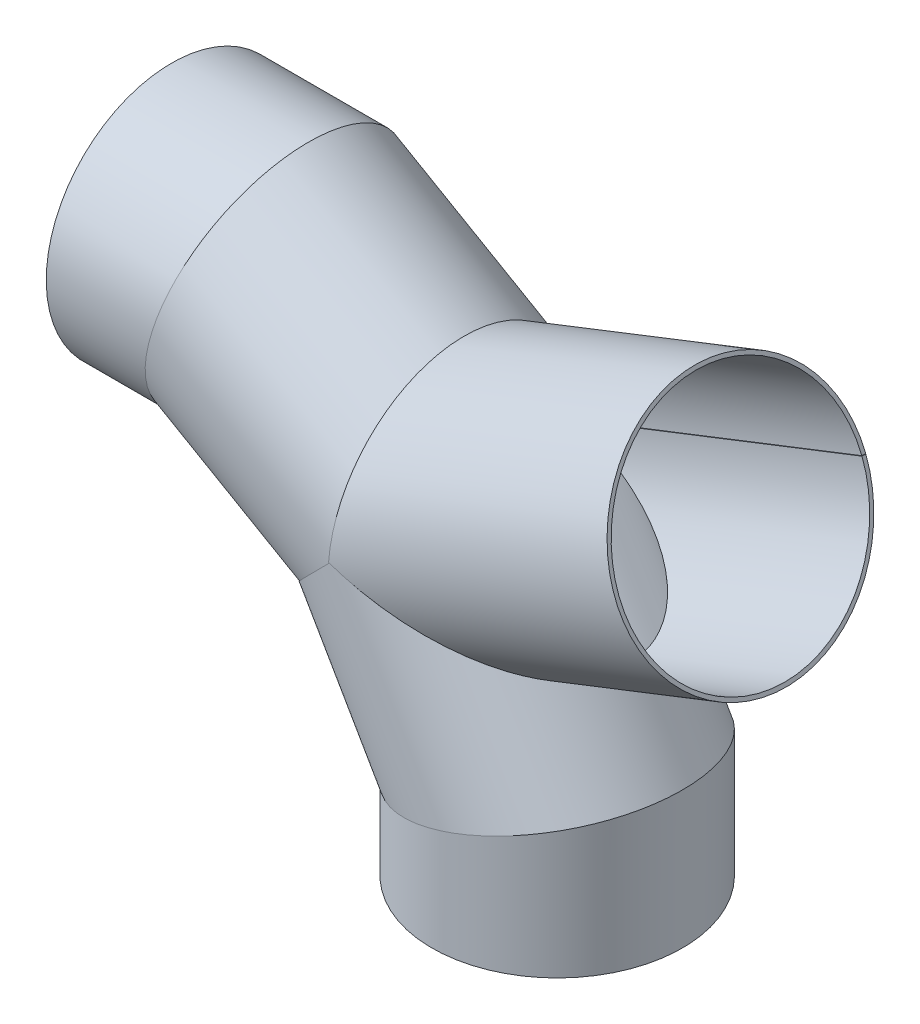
ISO-10303-21;
HEADER;
FILE_DESCRIPTION(('STEP AP214'),'2;1');
FILE_NAME('part.step','',(''),(''),'','','');
FILE_SCHEMA(('AUTOMOTIVE_DESIGN { 1 0 10303 214 1 1 1 1 }'));
ENDSEC;
DATA;
#1=APPLICATION_CONTEXT('core data for automotive mechanical design processes');
#2=APPLICATION_PROTOCOL_DEFINITION('international standard','automotive_design',2000,#1);
#3=PRODUCT_CONTEXT('',#1,'mechanical');
#4=PRODUCT('Part','Part','',(#3));
#5=PRODUCT_RELATED_PRODUCT_CATEGORY('part','',(#4));
#6=PRODUCT_DEFINITION_FORMATION('','',#4);
#7=PRODUCT_DEFINITION_CONTEXT('part definition',#1,'design');
#8=PRODUCT_DEFINITION('design','',#6,#7);
#9=PRODUCT_DEFINITION_SHAPE('','',#8);
#10=(LENGTH_UNIT() NAMED_UNIT(*) SI_UNIT(.MILLI.,.METRE.));
#11=(NAMED_UNIT(*) PLANE_ANGLE_UNIT() SI_UNIT($,.RADIAN.));
#12=(NAMED_UNIT(*) SI_UNIT($,.STERADIAN.) SOLID_ANGLE_UNIT());
#13=UNCERTAINTY_MEASURE_WITH_UNIT(LENGTH_MEASURE(1.E-05),#10,'distance_accuracy_value','');
#14=(GEOMETRIC_REPRESENTATION_CONTEXT(3) GLOBAL_UNCERTAINTY_ASSIGNED_CONTEXT((#13)) GLOBAL_UNIT_ASSIGNED_CONTEXT((#10,
#11,#12)) REPRESENTATION_CONTEXT('',''));
#15=CARTESIAN_POINT('',(0.,0.,0.));
#16=DIRECTION('',(0.,0.,1.));
#17=DIRECTION('',(1.,0.,0.));
#18=AXIS2_PLACEMENT_3D('',#15,#16,#17);
#19=CARTESIAN_POINT('',(-267.949192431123,732.050807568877,0.));
#20=DIRECTION('',(0.931256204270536,0.364365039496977,0.));
#21=DIRECTION('',(-0.364365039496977,0.931256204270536,0.));
#22=AXIS2_PLACEMENT_3D('',#19,#20,#21);
#23=CYLINDRICAL_SURFACE('',#22,325.);
#24=DIRECTION('',(0.931256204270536,0.364365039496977,0.));
#25=VECTOR('',#24,1.);
#26=CARTESIAN_POINT('',(-267.767009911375,731.585179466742,-324.999615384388));
#27=LINE('',#26,#25);
#28=CARTESIAN_POINT('',(475.3968278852,1022.35684882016,-324.999615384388));
#29=VERTEX_POINT('',#28);
#30=CARTESIAN_POINT('',(-267.225366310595,731.797103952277,-324.999615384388));
#31=VERTEX_POINT('',#30);
#32=EDGE_CURVE('E97',#29,#31,#27,.F.);
#33=ORIENTED_EDGE('',*,*,#32,.F.);
#34=CARTESIAN_POINT('',(475.214645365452,1022.8224769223,0.));
#35=DIRECTION('',(0.931256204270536,0.364365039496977,0.));
#36=DIRECTION('',(-0.364365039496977,0.931256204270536,0.));
#37=AXIS2_PLACEMENT_3D('',#34,#35,#36);
#38=CIRCLE('',#37,325.);
#39=CARTESIAN_POINT('',(475.032462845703,1023.28810502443,-324.999615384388));
#40=VERTEX_POINT('',#39);
#41=EDGE_CURVE('E141',#40,#29,#38,.T.);
#42=ORIENTED_EDGE('',*,*,#41,.F.);
#43=DIRECTION('',(0.931256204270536,0.364365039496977,0.));
#44=VECTOR('',#43,1.);
#45=CARTESIAN_POINT('',(-268.131374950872,732.516435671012,-324.999615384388));
#46=LINE('',#45,#44);
#47=CARTESIAN_POINT('',(-267.907440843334,732.604052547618,-324.999615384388));
#48=VERTEX_POINT('',#47);
#49=EDGE_CURVE('E127',#40,#48,#46,.F.);
#50=ORIENTED_EDGE('',*,*,#49,.T.);
#51=CARTESIAN_POINT('',(-267.949192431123,732.050807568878,0.));
#52=DIRECTION('',(-0.997164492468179,0.0752527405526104,0.));
#53=DIRECTION('',(0.0752527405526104,0.997164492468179,0.));
#54=AXIS2_PLACEMENT_3D('',#51,#52,#53);
#55=ELLIPSE('',#54,360.631810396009,325.);
#56=CARTESIAN_POINT('',(-267.949192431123,732.050807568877,325.));
#57=VERTEX_POINT('',#56);
#58=EDGE_CURVE('E161',#48,#57,#55,.F.);
#59=ORIENTED_EDGE('',*,*,#58,.T.);
#60=CARTESIAN_POINT('',(-267.949192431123,732.050807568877,0.));
#61=DIRECTION('',(-0.330773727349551,-0.943710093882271,0.));
#62=DIRECTION('',(0.943710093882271,-0.330773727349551,0.));
#63=AXIS2_PLACEMENT_3D('',#60,#61,#62);
#64=ELLIPSE('',#63,498.550329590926,325.);
#65=EDGE_CURVE('E151',#57,#31,#64,.F.);
#66=ORIENTED_EDGE('',*,*,#65,.T.);
#67=EDGE_LOOP('',(#33,#42,#50,#59,#66));
#68=FACE_BOUND('',#67,.T.);
#69=ADVANCED_FACE('F84',(#68),#23,.T.);
#70=CARTESIAN_POINT('',(-240.810660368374,1091.66004375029,-325.));
#71=DIRECTION('',(-0.997164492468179,0.0752527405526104,0.));
#72=DIRECTION('',(-0.0752527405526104,-0.997164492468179,0.));
#73=AXIS2_PLACEMENT_3D('',#70,#71,#72);
#74=PLANE('',#73);
#75=ORIENTED_EDGE('',*,*,#58,.F.);
#76=DIRECTION('',(0.,0.,1.));
#77=VECTOR('',#76,1.);
#78=CARTESIAN_POINT('',(-267.907440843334,732.604052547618,-325.));
#79=LINE('',#78,#77);
#80=CARTESIAN_POINT('',(-267.907440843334,732.604052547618,-314.999603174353));
#81=VERTEX_POINT('',#80);
#82=EDGE_CURVE('E91',#48,#81,#79,.T.);
#83=ORIENTED_EDGE('',*,*,#82,.T.);
#84=CARTESIAN_POINT('',(-267.949192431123,732.050807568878,0.));
#85=DIRECTION('',(-0.997164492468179,0.0752527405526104,0.));
#86=DIRECTION('',(0.0752527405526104,0.997164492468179,0.));
#87=AXIS2_PLACEMENT_3D('',#84,#85,#86);
#88=ELLIPSE('',#87,349.535446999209,315.);
#89=CARTESIAN_POINT('',(-267.949192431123,732.050807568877,315.));
#90=VERTEX_POINT('',#89);
#91=EDGE_CURVE('E147',#81,#90,#88,.F.);
#92=ORIENTED_EDGE('',*,*,#91,.T.);
#93=DIRECTION('',(0.,0.,1.));
#94=VECTOR('',#93,1.);
#95=CARTESIAN_POINT('',(-267.949192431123,732.050807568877,-325.));
#96=LINE('',#95,#94);
#97=EDGE_CURVE('E169',#90,#57,#96,.T.);
#98=ORIENTED_EDGE('',*,*,#97,.T.);
#99=EDGE_LOOP('',(#75,#83,#92,#98));
#100=FACE_BOUND('',#99,.T.);
#101=ADVANCED_FACE('F158',(#100),#74,.T.);
#102=CARTESIAN_POINT('',(-267.949192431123,732.050807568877,0.));
#103=DIRECTION('',(0.931256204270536,0.364365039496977,0.));
#104=DIRECTION('',(-0.364365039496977,0.931256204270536,0.));
#105=AXIS2_PLACEMENT_3D('',#102,#103,#104);
#106=CYLINDRICAL_SURFACE('',#105,315.);
#107=CARTESIAN_POINT('',(475.214645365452,1022.8224769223,0.));
#108=DIRECTION('',(0.931256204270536,0.364365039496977,0.));
#109=DIRECTION('',(-0.364365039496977,0.931256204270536,0.));
#110=AXIS2_PLACEMENT_3D('',#107,#108,#109);
#111=CIRCLE('',#110,315.);
#112=CARTESIAN_POINT('',(475.032462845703,1023.28810502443,-314.999603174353));
#113=VERTEX_POINT('',#112);
#114=CARTESIAN_POINT('',(475.3968278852,1022.35684882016,-314.999603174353));
#115=VERTEX_POINT('',#114);
#116=EDGE_CURVE('E143',#113,#115,#111,.T.);
#117=ORIENTED_EDGE('',*,*,#116,.T.);
#118=DIRECTION('',(0.931256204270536,0.364365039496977,0.));
#119=VECTOR('',#118,1.);
#120=CARTESIAN_POINT('',(-267.767009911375,731.585179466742,-314.999603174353));
#121=LINE('',#120,#119);
#122=CARTESIAN_POINT('',(-267.225366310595,731.797103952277,-314.999603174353));
#123=VERTEX_POINT('',#122);
#124=EDGE_CURVE('E134',#115,#123,#121,.F.);
#125=ORIENTED_EDGE('',*,*,#124,.T.);
#126=CARTESIAN_POINT('',(-267.949192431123,732.050807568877,0.));
#127=DIRECTION('',(-0.330773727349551,-0.943710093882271,0.));
#128=DIRECTION('',(0.943710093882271,-0.330773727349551,0.));
#129=AXIS2_PLACEMENT_3D('',#126,#127,#128);
#130=ELLIPSE('',#129,483.210319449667,315.);
#131=EDGE_CURVE('E149',#90,#123,#130,.F.);
#132=ORIENTED_EDGE('',*,*,#131,.F.);
#133=ORIENTED_EDGE('',*,*,#91,.F.);
#134=DIRECTION('',(0.931256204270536,0.364365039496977,0.));
#135=VECTOR('',#134,1.);
#136=CARTESIAN_POINT('',(-268.131374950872,732.516435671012,-314.999603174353));
#137=LINE('',#136,#135);
#138=EDGE_CURVE('E105',#113,#81,#137,.F.);
#139=ORIENTED_EDGE('',*,*,#138,.F.);
#140=EDGE_LOOP('',(#117,#125,#132,#133,#139));
#141=FACE_BOUND('',#140,.T.);
#142=ADVANCED_FACE('F164',(#141),#106,.F.);
#143=CARTESIAN_POINT('',(475.214645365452,1022.8224769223,0.));
#144=DIRECTION('',(0.931256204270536,0.364365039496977,0.));
#145=DIRECTION('',(-0.364365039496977,0.931256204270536,0.));
#146=AXIS2_PLACEMENT_3D('',#143,#144,#145);
#147=PLANE('',#146);
#148=DIRECTION('',(0.,0.,1.));
#149=VECTOR('',#148,1.);
#150=CARTESIAN_POINT('',(475.3968278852,1022.35684882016,-325.));
#151=LINE('',#150,#149);
#152=EDGE_CURVE('E144',#29,#115,#151,.T.);
#153=ORIENTED_EDGE('',*,*,#152,.T.);
#154=ORIENTED_EDGE('',*,*,#116,.F.);
#155=DIRECTION('',(0.,0.,1.));
#156=VECTOR('',#155,1.);
#157=CARTESIAN_POINT('',(475.032462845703,1023.28810502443,-325.));
#158=LINE('',#157,#156);
#159=EDGE_CURVE('E130',#40,#113,#158,.T.);
#160=ORIENTED_EDGE('',*,*,#159,.F.);
#161=ORIENTED_EDGE('',*,*,#41,.T.);
#162=EDGE_LOOP('',(#153,#154,#160,#161));
#163=FACE_BOUND('',#162,.T.);
#164=ADVANCED_FACE('F140',(#163),#147,.T.);
#165=CARTESIAN_POINT('',(-267.949192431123,732.050807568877,-325.));
#166=DIRECTION('',(-0.330773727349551,-0.943710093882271,0.));
#167=DIRECTION('',(0.943710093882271,-0.330773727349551,0.));
#168=AXIS2_PLACEMENT_3D('',#165,#166,#167);
#169=PLANE('',#168);
#170=DIRECTION('',(0.,0.,1.));
#171=VECTOR('',#170,1.);
#172=CARTESIAN_POINT('',(-267.225366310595,731.797103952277,-325.));
#173=LINE('',#172,#171);
#174=EDGE_CURVE('E14',#31,#123,#173,.T.);
#175=ORIENTED_EDGE('',*,*,#174,.F.);
#176=ORIENTED_EDGE('',*,*,#65,.F.);
#177=ORIENTED_EDGE('',*,*,#97,.F.);
#178=ORIENTED_EDGE('',*,*,#131,.T.);
#179=EDGE_LOOP('',(#175,#176,#177,#178));
#180=FACE_BOUND('',#179,.T.);
#181=ADVANCED_FACE('F167',(#180),#169,.T.);
#182=CARTESIAN_POINT('',(-268.131374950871,732.516435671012,-325.));
#183=DIRECTION('',(0.364365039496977,-0.931256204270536,0.));
#184=DIRECTION('',(0.931256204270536,0.364365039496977,0.));
#185=AXIS2_PLACEMENT_3D('',#182,#183,#184);
#186=PLANE('',#185);
#187=ORIENTED_EDGE('',*,*,#159,.T.);
#188=ORIENTED_EDGE('',*,*,#138,.T.);
#189=ORIENTED_EDGE('',*,*,#82,.F.);
#190=ORIENTED_EDGE('',*,*,#49,.F.);
#191=EDGE_LOOP('',(#187,#188,#189,#190));
#192=FACE_BOUND('',#191,.T.);
#193=ADVANCED_FACE('F129',(#192),#186,.T.);
#194=CARTESIAN_POINT('',(-267.767009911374,731.585179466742,-325.));
#195=DIRECTION('',(0.364365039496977,-0.931256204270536,0.));
#196=DIRECTION('',(0.931256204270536,0.364365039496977,0.));
#197=AXIS2_PLACEMENT_3D('',#194,#195,#196);
#198=PLANE('',#197);
#199=ORIENTED_EDGE('',*,*,#32,.T.);
#200=ORIENTED_EDGE('',*,*,#174,.T.);
#201=ORIENTED_EDGE('',*,*,#124,.F.);
#202=ORIENTED_EDGE('',*,*,#152,.F.);
#203=EDGE_LOOP('',(#199,#200,#201,#202));
#204=FACE_BOUND('',#203,.T.);
#205=ADVANCED_FACE('F176',(#204),#198,.F.);
#206=CLOSED_SHELL('',(#69,#101,#142,#164,#181,#193,#205));
#207=MANIFOLD_SOLID_BREP('B2',#206);
#208=CARTESIAN_POINT('',(-1000.,1000.,0.));
#209=DIRECTION('',(1.,0.,0.));
#210=DIRECTION('',(0.,1.,0.));
#211=AXIS2_PLACEMENT_3D('',#208,#209,#210);
#212=PLANE('',#211);
#213=DIRECTION('',(0.,-1.,0.));
#214=VECTOR('',#213,1.);
#215=CARTESIAN_POINT('',(-1000.,1000.,0.5));
#216=LINE('',#215,#214);
#217=CARTESIAN_POINT('',(-1000.,685.000396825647,0.49999999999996));
#218=VERTEX_POINT('',#217);
#219=CARTESIAN_POINT('',(-1000.,675.000384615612,0.499999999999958));
#220=VERTEX_POINT('',#219);
#221=EDGE_CURVE('E297',#218,#220,#216,.T.);
#222=ORIENTED_EDGE('',*,*,#221,.T.);
#223=CARTESIAN_POINT('',(-1000.,1000.,0.));
#224=DIRECTION('',(1.,0.,0.));
#225=DIRECTION('',(0.,1.,0.));
#226=AXIS2_PLACEMENT_3D('',#223,#224,#225);
#227=CIRCLE('',#226,325.);
#228=CARTESIAN_POINT('',(-1000.,675.000384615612,-0.500000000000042));
#229=VERTEX_POINT('',#228);
#230=EDGE_CURVE('E296',#229,#220,#227,.T.);
#231=ORIENTED_EDGE('',*,*,#230,.F.);
#232=DIRECTION('',(0.,-1.,0.));
#233=VECTOR('',#232,1.);
#234=CARTESIAN_POINT('',(-1000.,1000.,-0.5));
#235=LINE('',#234,#233);
#236=CARTESIAN_POINT('',(-1000.,685.000396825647,-0.50000000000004));
#237=VERTEX_POINT('',#236);
#238=EDGE_CURVE('E284',#237,#229,#235,.T.);
#239=ORIENTED_EDGE('',*,*,#238,.F.);
#240=CARTESIAN_POINT('',(-1000.,1000.,0.));
#241=DIRECTION('',(1.,0.,0.));
#242=DIRECTION('',(0.,0.,-1.));
#243=AXIS2_PLACEMENT_3D('',#240,#241,#242);
#244=CIRCLE('',#243,315.);
#245=EDGE_CURVE('E294',#237,#218,#244,.T.);
#246=ORIENTED_EDGE('',*,*,#245,.T.);
#247=EDGE_LOOP('',(#222,#231,#239,#246));
#248=FACE_BOUND('',#247,.T.);
#249=ADVANCED_FACE('F243',(#248),#212,.F.);
#250=CARTESIAN_POINT('',(-644.967320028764,1000.,0.));
#251=DIRECTION('',(-1.,0.,0.));
#252=DIRECTION('',(0.,-1.,0.));
#253=AXIS2_PLACEMENT_3D('',#250,#251,#252);
#254=CYLINDRICAL_SURFACE('',#253,325.);
#255=DIRECTION('',(-1.,0.,0.));
#256=VECTOR('',#255,1.);
#257=CARTESIAN_POINT('',(-644.967320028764,675.000384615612,0.499999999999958));
#258=LINE('',#257,#256);
#259=CARTESIAN_POINT('',(-819.13419205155,675.000384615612,0.500000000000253));
#260=VERTEX_POINT('',#259);
#261=EDGE_CURVE('E305',#260,#220,#258,.T.);
#262=ORIENTED_EDGE('',*,*,#261,.F.);
#263=CARTESIAN_POINT('',(-732.050807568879,1000.,0.));
#264=DIRECTION('',(-0.965925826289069,0.25881904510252,0.));
#265=DIRECTION('',(-0.25881904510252,-0.965925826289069,0.));
#266=AXIS2_PLACEMENT_3D('',#263,#264,#265);
#267=ELLIPSE('',#266,336.464758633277,325.);
#268=CARTESIAN_POINT('',(-819.13419205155,675.000384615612,-0.50000000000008));
#269=VERTEX_POINT('',#268);
#270=EDGE_CURVE('E300',#260,#269,#267,.T.);
#271=ORIENTED_EDGE('',*,*,#270,.T.);
#272=DIRECTION('',(-1.,0.,0.));
#273=VECTOR('',#272,1.);
#274=CARTESIAN_POINT('',(-644.967320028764,675.000384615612,-0.500000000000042));
#275=LINE('',#274,#273);
#276=EDGE_CURVE('E258',#269,#229,#275,.T.);
#277=ORIENTED_EDGE('',*,*,#276,.T.);
#278=ORIENTED_EDGE('',*,*,#230,.T.);
#279=EDGE_LOOP('',(#262,#271,#277,#278));
#280=FACE_BOUND('',#279,.T.);
#281=ADVANCED_FACE('F245',(#280),#254,.T.);
#282=CARTESIAN_POINT('',(-644.967320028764,1000.,0.));
#283=DIRECTION('',(-1.,0.,0.));
#284=DIRECTION('',(0.,-1.,0.));
#285=AXIS2_PLACEMENT_3D('',#282,#283,#284);
#286=CYLINDRICAL_SURFACE('',#285,315.);
#287=CARTESIAN_POINT('',(-732.050807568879,1000.,0.));
#288=DIRECTION('',(-0.965925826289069,0.25881904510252,0.));
#289=DIRECTION('',(-0.25881904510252,-0.965925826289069,0.));
#290=AXIS2_PLACEMENT_3D('',#287,#288,#289);
#291=ELLIPSE('',#290,326.111996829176,315.);
#292=CARTESIAN_POINT('',(-816.45469685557,685.000396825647,0.500000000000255));
#293=VERTEX_POINT('',#292);
#294=CARTESIAN_POINT('',(-816.45469685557,685.000396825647,-0.500000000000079));
#295=VERTEX_POINT('',#294);
#296=EDGE_CURVE('E302',#293,#295,#291,.T.);
#297=ORIENTED_EDGE('',*,*,#296,.F.);
#298=DIRECTION('',(-1.,0.,0.));
#299=VECTOR('',#298,1.);
#300=CARTESIAN_POINT('',(-644.967320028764,685.000396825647,0.49999999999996));
#301=LINE('',#300,#299);
#302=EDGE_CURVE('E265',#293,#218,#301,.T.);
#303=ORIENTED_EDGE('',*,*,#302,.T.);
#304=ORIENTED_EDGE('',*,*,#245,.F.);
#305=DIRECTION('',(-1.,0.,0.));
#306=VECTOR('',#305,1.);
#307=CARTESIAN_POINT('',(-644.967320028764,685.000396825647,-0.50000000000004));
#308=LINE('',#307,#306);
#309=EDGE_CURVE('E281',#295,#237,#308,.T.);
#310=ORIENTED_EDGE('',*,*,#309,.F.);
#311=EDGE_LOOP('',(#297,#303,#304,#310));
#312=FACE_BOUND('',#311,.T.);
#313=ADVANCED_FACE('F299',(#312),#286,.F.);
#314=CARTESIAN_POINT('',(-1000.,-1.22464679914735E-13,3121.67648647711));
#315=DIRECTION('',(-0.965925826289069,0.25881904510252,0.));
#316=DIRECTION('',(-0.25881904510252,-0.965925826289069,0.));
#317=AXIS2_PLACEMENT_3D('',#314,#315,#316);
#318=PLANE('',#317);
#319=DIRECTION('',(-0.25881904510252,-0.965925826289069,0.));
#320=VECTOR('',#319,1.);
#321=CARTESIAN_POINT('',(-1000.,2.50582721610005E-13,0.500000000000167));
#322=LINE('',#321,#320);
#323=EDGE_CURVE('E82',#293,#260,#322,.T.);
#324=ORIENTED_EDGE('',*,*,#323,.F.);
#325=ORIENTED_EDGE('',*,*,#296,.T.);
#326=DIRECTION('',(-0.25881904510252,-0.965925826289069,0.));
#327=VECTOR('',#326,1.);
#328=CARTESIAN_POINT('',(-1000.,2.5070224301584E-13,-0.500000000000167));
#329=LINE('',#328,#327);
#330=EDGE_CURVE('E251',#295,#269,#329,.T.);
#331=ORIENTED_EDGE('',*,*,#330,.T.);
#332=ORIENTED_EDGE('',*,*,#270,.F.);
#333=EDGE_LOOP('',(#324,#325,#331,#332));
#334=FACE_BOUND('',#333,.T.);
#335=ADVANCED_FACE('F311',(#334),#318,.F.);
#336=CARTESIAN_POINT('',(593.633283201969,1000.,-0.5));
#337=DIRECTION('',(0.,0.,-1.));
#338=DIRECTION('',(0.,1.,0.));
#339=AXIS2_PLACEMENT_3D('',#336,#337,#338);
#340=PLANE('',#339);
#341=ORIENTED_EDGE('',*,*,#330,.F.);
#342=ORIENTED_EDGE('',*,*,#309,.T.);
#343=ORIENTED_EDGE('',*,*,#238,.T.);
#344=ORIENTED_EDGE('',*,*,#276,.F.);
#345=EDGE_LOOP('',(#341,#342,#343,#344));
#346=FACE_BOUND('',#345,.T.);
#347=ADVANCED_FACE('F283',(#346),#340,.F.);
#348=CARTESIAN_POINT('',(593.633283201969,1000.,0.5));
#349=DIRECTION('',(0.,0.,-1.));
#350=DIRECTION('',(0.,1.,0.));
#351=AXIS2_PLACEMENT_3D('',#348,#349,#350);
#352=PLANE('',#351);
#353=ORIENTED_EDGE('',*,*,#261,.T.);
#354=ORIENTED_EDGE('',*,*,#221,.F.);
#355=ORIENTED_EDGE('',*,*,#302,.F.);
#356=ORIENTED_EDGE('',*,*,#323,.T.);
#357=EDGE_LOOP('',(#353,#354,#355,#356));
#358=FACE_BOUND('',#357,.T.);
#359=ADVANCED_FACE('F317',(#358),#352,.T.);
#360=CLOSED_SHELL('',(#249,#281,#313,#335,#347,#359));
#361=MANIFOLD_SOLID_BREP('B8',#360);
#362=CARTESIAN_POINT('',(-807.467320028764,1043.54174377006,0.));
#363=DIRECTION('',(0.866025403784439,-0.5,0.));
#364=DIRECTION('',(0.5,0.866025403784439,0.));
#365=AXIS2_PLACEMENT_3D('',#362,#363,#364);
#366=CYLINDRICAL_SURFACE('',#365,325.);
#367=CARTESIAN_POINT('',(-266.404258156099,731.158839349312,0.));
#368=DIRECTION('',(-0.71072374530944,0.703471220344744,0.));
#369=DIRECTION('',(0.703471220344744,0.71072374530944,0.));
#370=AXIS2_PLACEMENT_3D('',#367,#368,#369);
#371=ELLIPSE('',#370,336.007460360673,325.);
#372=CARTESIAN_POINT('',(-266.146718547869,731.419034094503,-324.999807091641));
#373=VERTEX_POINT('',#372);
#374=CARTESIAN_POINT('',(-502.775556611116,492.350641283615,-0.500000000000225));
#375=VERTEX_POINT('',#374);
#376=EDGE_CURVE('E456',#373,#375,#371,.T.);
#377=ORIENTED_EDGE('',*,*,#376,.T.);
#378=DIRECTION('',(0.866025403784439,-0.5,0.));
#379=VECTOR('',#378,1.);
#380=CARTESIAN_POINT('',(-969.967127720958,762.083820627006,-0.499999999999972));
#381=LINE('',#380,#379);
#382=CARTESIAN_POINT('',(-819.13419205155,675.000384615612,-0.499999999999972));
#383=VERTEX_POINT('',#382);
#384=EDGE_CURVE('E390',#375,#383,#381,.F.);
#385=ORIENTED_EDGE('',*,*,#384,.T.);
#386=CARTESIAN_POINT('',(-732.050807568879,1000.,0.));
#387=DIRECTION('',(-0.965925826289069,0.25881904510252,0.));
#388=DIRECTION('',(-0.25881904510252,-0.965925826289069,0.));
#389=AXIS2_PLACEMENT_3D('',#386,#387,#388);
#390=ELLIPSE('',#389,336.464758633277,325.);
#391=CARTESIAN_POINT('',(-819.13419205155,675.000384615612,0.500000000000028));
#392=VERTEX_POINT('',#391);
#393=EDGE_CURVE('E450',#392,#383,#390,.T.);
#394=ORIENTED_EDGE('',*,*,#393,.F.);
#395=DIRECTION('',(0.866025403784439,-0.5,0.));
#396=VECTOR('',#395,1.);
#397=CARTESIAN_POINT('',(-969.967127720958,762.083820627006,0.500000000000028));
#398=LINE('',#397,#396);
#399=CARTESIAN_POINT('',(-502.775556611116,492.350641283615,0.500000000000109));
#400=VERTEX_POINT('',#399);
#401=EDGE_CURVE('E438',#400,#392,#398,.F.);
#402=ORIENTED_EDGE('',*,*,#401,.F.);
#403=CARTESIAN_POINT('',(-266.146718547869,731.419034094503,324.999807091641));
#404=VERTEX_POINT('',#403);
#405=EDGE_CURVE('E447',#400,#404,#371,.T.);
#406=ORIENTED_EDGE('',*,*,#405,.T.);
#407=CARTESIAN_POINT('',(-267.949192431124,732.050807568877,0.));
#408=DIRECTION('',(-0.330773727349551,-0.943710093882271,0.));
#409=DIRECTION('',(0.943710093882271,-0.330773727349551,0.));
#410=AXIS2_PLACEMENT_3D('',#407,#408,#409);
#411=ELLIPSE('',#410,1752.99874294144,325.);
#412=CARTESIAN_POINT('',(-267.949192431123,732.050807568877,325.));
#413=VERTEX_POINT('',#412);
#414=EDGE_CURVE('E473',#404,#413,#411,.T.);
#415=ORIENTED_EDGE('',*,*,#414,.T.);
#416=CARTESIAN_POINT('',(-267.949192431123,732.050807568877,0.));
#417=DIRECTION('',(-0.997164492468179,0.0752527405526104,0.));
#418=DIRECTION('',(-0.0752527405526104,-0.997164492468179,0.));
#419=AXIS2_PLACEMENT_3D('',#416,#417,#418);
#420=ELLIPSE('',#419,360.631810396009,325.);
#421=CARTESIAN_POINT('',(-267.949192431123,732.050807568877,-325.));
#422=VERTEX_POINT('',#421);
#423=EDGE_CURVE('E477',#413,#422,#420,.T.);
#424=ORIENTED_EDGE('',*,*,#423,.T.);
#425=EDGE_CURVE('E476',#422,#373,#411,.T.);
#426=ORIENTED_EDGE('',*,*,#425,.T.);
#427=EDGE_LOOP('',(#377,#385,#394,#402,#406,#415,#424,#426));
#428=FACE_BOUND('',#427,.T.);
#429=ADVANCED_FACE('F376',(#428),#366,.T.);
#430=CARTESIAN_POINT('',(-1000.,-10.0000000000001,3121.67648647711));
#431=DIRECTION('',(-0.71072374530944,0.703471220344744,0.));
#432=DIRECTION('',(-0.703471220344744,-0.71072374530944,0.));
#433=AXIS2_PLACEMENT_3D('',#430,#431,#432);
#434=PLANE('',#433);
#435=DIRECTION('',(-0.703471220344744,-0.71072374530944,0.));
#436=VECTOR('',#435,1.);
#437=CARTESIAN_POINT('',(-1000.,-10.0000000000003,0.500000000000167));
#438=LINE('',#437,#436);
#439=CARTESIAN_POINT('',(-495.502576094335,499.698603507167,0.500000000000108));
#440=VERTEX_POINT('',#439);
#441=EDGE_CURVE('E383',#440,#400,#438,.T.);
#442=ORIENTED_EDGE('',*,*,#441,.F.);
#443=CARTESIAN_POINT('',(-266.404258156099,731.158839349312,0.));
#444=DIRECTION('',(-0.71072374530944,0.703471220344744,0.));
#445=DIRECTION('',(0.703471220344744,0.71072374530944,0.));
#446=AXIS2_PLACEMENT_3D('',#443,#444,#445);
#447=ELLIPSE('',#446,325.668769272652,315.);
#448=CARTESIAN_POINT('',(-266.146718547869,731.419034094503,314.999800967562));
#449=VERTEX_POINT('',#448);
#450=EDGE_CURVE('E461',#440,#449,#447,.T.);
#451=ORIENTED_EDGE('',*,*,#450,.T.);
#452=DIRECTION('',(0.,0.,-1.));
#453=VECTOR('',#452,1.);
#454=CARTESIAN_POINT('',(-266.146718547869,731.419034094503,-325.));
#455=LINE('',#454,#453);
#456=EDGE_CURVE('E443',#404,#449,#455,.T.);
#457=ORIENTED_EDGE('',*,*,#456,.F.);
#458=ORIENTED_EDGE('',*,*,#405,.F.);
#459=EDGE_LOOP('',(#442,#451,#457,#458));
#460=FACE_BOUND('',#459,.T.);
#461=ADVANCED_FACE('F453',(#460),#434,.F.);
#462=CARTESIAN_POINT('',(-807.467320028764,1043.54174377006,0.));
#463=DIRECTION('',(0.866025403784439,-0.5,0.));
#464=DIRECTION('',(0.5,0.866025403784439,0.));
#465=AXIS2_PLACEMENT_3D('',#462,#463,#464);
#466=CYLINDRICAL_SURFACE('',#465,315.);
#467=DIRECTION('',(0.866025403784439,-0.5,0.));
#468=VECTOR('',#467,1.);
#469=CARTESIAN_POINT('',(-964.96712161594,770.744085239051,-0.499999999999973));
#470=LINE('',#469,#468);
#471=CARTESIAN_POINT('',(-495.502576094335,499.698603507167,-0.500000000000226));
#472=VERTEX_POINT('',#471);
#473=CARTESIAN_POINT('',(-816.45469685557,685.000396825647,-0.499999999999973));
#474=VERTEX_POINT('',#473);
#475=EDGE_CURVE('E508',#472,#474,#470,.F.);
#476=ORIENTED_EDGE('',*,*,#475,.F.);
#477=CARTESIAN_POINT('',(-266.146718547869,731.419034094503,-314.999800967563));
#478=VERTEX_POINT('',#477);
#479=EDGE_CURVE('E457',#478,#472,#447,.T.);
#480=ORIENTED_EDGE('',*,*,#479,.F.);
#481=CARTESIAN_POINT('',(-267.949192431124,732.050807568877,0.));
#482=DIRECTION('',(-0.330773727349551,-0.943710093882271,0.));
#483=DIRECTION('',(0.943710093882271,-0.330773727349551,0.));
#484=AXIS2_PLACEMENT_3D('',#481,#482,#483);
#485=ELLIPSE('',#484,1699.0603200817,315.);
#486=CARTESIAN_POINT('',(-267.949192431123,732.050807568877,-315.));
#487=VERTEX_POINT('',#486);
#488=EDGE_CURVE('E474',#487,#478,#485,.T.);
#489=ORIENTED_EDGE('',*,*,#488,.F.);
#490=CARTESIAN_POINT('',(-267.949192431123,732.050807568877,0.));
#491=DIRECTION('',(-0.997164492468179,0.0752527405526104,0.));
#492=DIRECTION('',(-0.0752527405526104,-0.997164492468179,0.));
#493=AXIS2_PLACEMENT_3D('',#490,#491,#492);
#494=ELLIPSE('',#493,349.535446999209,315.);
#495=CARTESIAN_POINT('',(-267.949192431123,732.050807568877,315.));
#496=VERTEX_POINT('',#495);
#497=EDGE_CURVE('E481',#496,#487,#494,.T.);
#498=ORIENTED_EDGE('',*,*,#497,.F.);
#499=EDGE_CURVE('E471',#449,#496,#485,.T.);
#500=ORIENTED_EDGE('',*,*,#499,.F.);
#501=ORIENTED_EDGE('',*,*,#450,.F.);
#502=DIRECTION('',(0.866025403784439,-0.5,0.));
#503=VECTOR('',#502,1.);
#504=CARTESIAN_POINT('',(-964.96712161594,770.744085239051,0.500000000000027));
#505=LINE('',#504,#503);
#506=CARTESIAN_POINT('',(-816.45469685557,685.000396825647,0.500000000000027));
#507=VERTEX_POINT('',#506);
#508=EDGE_CURVE('E397',#440,#507,#505,.F.);
#509=ORIENTED_EDGE('',*,*,#508,.T.);
#510=CARTESIAN_POINT('',(-732.050807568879,1000.,0.));
#511=DIRECTION('',(-0.965925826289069,0.25881904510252,0.));
#512=DIRECTION('',(-0.25881904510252,-0.965925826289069,0.));
#513=AXIS2_PLACEMENT_3D('',#510,#511,#512);
#514=ELLIPSE('',#513,326.111996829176,315.);
#515=EDGE_CURVE('E479',#507,#474,#514,.T.);
#516=ORIENTED_EDGE('',*,*,#515,.T.);
#517=EDGE_LOOP('',(#476,#480,#489,#498,#500,#501,#509,#516));
#518=FACE_BOUND('',#517,.T.);
#519=ADVANCED_FACE('F493',(#518),#466,.F.);
#520=CARTESIAN_POINT('',(-1000.,-1.22464679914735E-13,3121.67648647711));
#521=DIRECTION('',(-0.965925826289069,0.25881904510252,0.));
#522=DIRECTION('',(-0.25881904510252,-0.965925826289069,0.));
#523=AXIS2_PLACEMENT_3D('',#520,#521,#522);
#524=PLANE('',#523);
#525=DIRECTION('',(-0.25881904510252,-0.965925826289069,0.));
#526=VECTOR('',#525,1.);
#527=CARTESIAN_POINT('',(-1000.,-3.71242628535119E-13,-0.500000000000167));
#528=LINE('',#527,#526);
#529=EDGE_CURVE('E512',#474,#383,#528,.T.);
#530=ORIENTED_EDGE('',*,*,#529,.F.);
#531=ORIENTED_EDGE('',*,*,#515,.F.);
#532=DIRECTION('',(-0.25881904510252,-0.965925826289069,0.));
#533=VECTOR('',#532,1.);
#534=CARTESIAN_POINT('',(-1000.,-3.71162947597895E-13,0.500000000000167));
#535=LINE('',#534,#533);
#536=EDGE_CURVE('E451',#507,#392,#535,.T.);
#537=ORIENTED_EDGE('',*,*,#536,.T.);
#538=ORIENTED_EDGE('',*,*,#393,.T.);
#539=EDGE_LOOP('',(#530,#531,#537,#538));
#540=FACE_BOUND('',#539,.T.);
#541=ADVANCED_FACE('F516',(#540),#524,.T.);
#542=CARTESIAN_POINT('',(-240.810660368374,1091.66004375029,-325.));
#543=DIRECTION('',(-0.997164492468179,0.0752527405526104,0.));
#544=DIRECTION('',(-0.0752527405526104,-0.997164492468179,0.));
#545=AXIS2_PLACEMENT_3D('',#542,#543,#544);
#546=PLANE('',#545);
#547=DIRECTION('',(0.,0.,1.));
#548=VECTOR('',#547,1.);
#549=CARTESIAN_POINT('',(-267.949192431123,732.050807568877,-325.));
#550=LINE('',#549,#548);
#551=EDGE_CURVE('E467',#496,#413,#550,.T.);
#552=ORIENTED_EDGE('',*,*,#551,.F.);
#553=ORIENTED_EDGE('',*,*,#497,.T.);
#554=EDGE_CURVE('E468',#422,#487,#550,.T.);
#555=ORIENTED_EDGE('',*,*,#554,.F.);
#556=ORIENTED_EDGE('',*,*,#423,.F.);
#557=EDGE_LOOP('',(#552,#553,#555,#556));
#558=FACE_BOUND('',#557,.T.);
#559=ADVANCED_FACE('F499',(#558),#546,.F.);
#560=CARTESIAN_POINT('',(-267.949192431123,732.050807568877,-325.));
#561=DIRECTION('',(-0.330773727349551,-0.943710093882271,0.));
#562=DIRECTION('',(0.943710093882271,-0.330773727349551,0.));
#563=AXIS2_PLACEMENT_3D('',#560,#561,#562);
#564=PLANE('',#563);
#565=ORIENTED_EDGE('',*,*,#488,.T.);
#566=DIRECTION('',(0.,0.,-1.));
#567=VECTOR('',#566,1.);
#568=CARTESIAN_POINT('',(-266.146718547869,731.419034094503,-325.));
#569=LINE('',#568,#567);
#570=EDGE_CURVE('E459',#478,#373,#569,.T.);
#571=ORIENTED_EDGE('',*,*,#570,.T.);
#572=ORIENTED_EDGE('',*,*,#425,.F.);
#573=ORIENTED_EDGE('',*,*,#554,.T.);
#574=EDGE_LOOP('',(#565,#571,#572,#573));
#575=FACE_BOUND('',#574,.T.);
#576=ADVANCED_FACE('F503',(#575),#564,.F.);
#577=ORIENTED_EDGE('',*,*,#414,.F.);
#578=ORIENTED_EDGE('',*,*,#456,.T.);
#579=ORIENTED_EDGE('',*,*,#499,.T.);
#580=ORIENTED_EDGE('',*,*,#551,.T.);
#581=EDGE_LOOP('',(#577,#578,#579,#580));
#582=FACE_BOUND('',#581,.T.);
#583=ADVANCED_FACE('F487',(#582),#564,.F.);
#584=ORIENTED_EDGE('',*,*,#479,.T.);
#585=DIRECTION('',(-0.703471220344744,-0.71072374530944,0.));
#586=VECTOR('',#585,1.);
#587=CARTESIAN_POINT('',(-1000.,-10.0000000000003,-0.500000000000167));
#588=LINE('',#587,#586);
#589=EDGE_CURVE('E241',#472,#375,#588,.T.);
#590=ORIENTED_EDGE('',*,*,#589,.T.);
#591=ORIENTED_EDGE('',*,*,#376,.F.);
#592=ORIENTED_EDGE('',*,*,#570,.F.);
#593=EDGE_LOOP('',(#584,#590,#591,#592));
#594=FACE_BOUND('',#593,.T.);
#595=ADVANCED_FACE('F506',(#594),#434,.F.);
#596=CARTESIAN_POINT('',(695.224962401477,175.961949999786,0.5));
#597=DIRECTION('',(0.,0.,-1.));
#598=DIRECTION('',(0.,1.,0.));
#599=AXIS2_PLACEMENT_3D('',#596,#597,#598);
#600=PLANE('',#599);
#601=ORIENTED_EDGE('',*,*,#508,.F.);
#602=ORIENTED_EDGE('',*,*,#441,.T.);
#603=ORIENTED_EDGE('',*,*,#401,.T.);
#604=ORIENTED_EDGE('',*,*,#536,.F.);
#605=EDGE_LOOP('',(#601,#602,#603,#604));
#606=FACE_BOUND('',#605,.T.);
#607=ADVANCED_FACE('F437',(#606),#600,.T.);
#608=CARTESIAN_POINT('',(695.224962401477,175.961949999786,-0.5));
#609=DIRECTION('',(0.,0.,-1.));
#610=DIRECTION('',(0.,1.,0.));
#611=AXIS2_PLACEMENT_3D('',#608,#609,#610);
#612=PLANE('',#611);
#613=ORIENTED_EDGE('',*,*,#529,.T.);
#614=ORIENTED_EDGE('',*,*,#384,.F.);
#615=ORIENTED_EDGE('',*,*,#589,.F.);
#616=ORIENTED_EDGE('',*,*,#475,.T.);
#617=EDGE_LOOP('',(#613,#614,#615,#616));
#618=FACE_BOUND('',#617,.T.);
#619=ADVANCED_FACE('F507',(#618),#612,.F.);
#620=CLOSED_SHELL('',(#429,#461,#519,#541,#559,#576,#583,#595,#607,#619));
#621=MANIFOLD_SOLID_BREP('B76',#620);
#622=CARTESIAN_POINT('',(-311.49093620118,807.467320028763,0.));
#623=DIRECTION('',(0.5,-0.866025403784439,0.));
#624=DIRECTION('',(0.866025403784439,0.5,0.));
#625=AXIS2_PLACEMENT_3D('',#622,#623,#624);
#626=CYLINDRICAL_SURFACE('',#625,324.999999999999);
#627=DIRECTION('',(0.5,-0.866025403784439,0.));
#628=VECTOR('',#627,1.);
#629=CARTESIAN_POINT('',(-592.948859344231,644.967512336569,0.499999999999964));
#630=LINE('',#629,#628);
#631=CARTESIAN_POINT('',(-324.999615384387,180.86580794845,0.499999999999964));
#632=VERTEX_POINT('',#631);
#633=CARTESIAN_POINT('',(-504.076578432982,491.036206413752,0.500000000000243));
#634=VERTEX_POINT('',#633);
#635=EDGE_CURVE('E626',#632,#634,#630,.F.);
#636=ORIENTED_EDGE('',*,*,#635,.F.);
#637=CARTESIAN_POINT('',(7.21644966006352E-13,267.949192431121,0.));
#638=DIRECTION('',(-0.25881904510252,0.965925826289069,0.));
#639=DIRECTION('',(0.965925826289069,0.25881904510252,0.));
#640=AXIS2_PLACEMENT_3D('',#637,#638,#639);
#641=ELLIPSE('',#640,336.464758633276,324.999999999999);
#642=CARTESIAN_POINT('',(-324.999615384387,180.86580794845,-0.500000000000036));
#643=VERTEX_POINT('',#642);
#644=EDGE_CURVE('E667',#643,#632,#641,.F.);
#645=ORIENTED_EDGE('',*,*,#644,.F.);
#646=DIRECTION('',(0.5,-0.866025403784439,0.));
#647=VECTOR('',#646,1.);
#648=CARTESIAN_POINT('',(-592.948859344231,644.967512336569,-0.500000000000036));
#649=LINE('',#648,#647);
#650=CARTESIAN_POINT('',(-504.076578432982,491.036206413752,-0.500000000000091));
#651=VERTEX_POINT('',#650);
#652=EDGE_CURVE('E655',#643,#651,#649,.F.);
#653=ORIENTED_EDGE('',*,*,#652,.T.);
#654=CARTESIAN_POINT('',(-267.05476945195,730.501621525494,0.));
#655=DIRECTION('',(-0.71072374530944,0.703471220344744,0.));
#656=DIRECTION('',(-0.703471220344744,-0.71072374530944,0.));
#657=AXIS2_PLACEMENT_3D('',#654,#655,#656);
#658=ELLIPSE('',#657,336.932176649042,324.999999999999);
#659=CARTESIAN_POINT('',(-266.146718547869,731.419034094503,-324.997614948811));
#660=VERTEX_POINT('',#659);
#661=EDGE_CURVE('E664',#651,#660,#658,.F.);
#662=ORIENTED_EDGE('',*,*,#661,.T.);
#663=CARTESIAN_POINT('',(-267.949192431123,732.050807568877,0.));
#664=DIRECTION('',(-0.330773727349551,-0.943710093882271,0.));
#665=DIRECTION('',(0.943710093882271,-0.330773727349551,0.));
#666=AXIS2_PLACEMENT_3D('',#663,#664,#665);
#667=ELLIPSE('',#666,498.550329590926,324.999999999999);
#668=CARTESIAN_POINT('',(-266.146718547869,731.419034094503,324.99761494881));
#669=VERTEX_POINT('',#668);
#670=EDGE_CURVE('E678',#669,#660,#667,.F.);
#671=ORIENTED_EDGE('',*,*,#670,.F.);
#672=EDGE_CURVE('E674',#669,#634,#658,.F.);
#673=ORIENTED_EDGE('',*,*,#672,.T.);
#674=EDGE_LOOP('',(#636,#645,#653,#662,#671,#673));
#675=FACE_BOUND('',#674,.T.);
#676=ADVANCED_FACE('F605',(#675),#626,.T.);
#677=CARTESIAN_POINT('',(-1000.,-10.0000000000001,3121.67648647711));
#678=DIRECTION('',(-0.71072374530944,0.703471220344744,0.));
#679=DIRECTION('',(-0.703471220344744,-0.71072374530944,0.));
#680=AXIS2_PLACEMENT_3D('',#677,#678,#679);
#681=PLANE('',#680);
#682=ORIENTED_EDGE('',*,*,#661,.F.);
#683=DIRECTION('',(0.703471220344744,0.71072374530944,0.));
#684=VECTOR('',#683,1.);
#685=CARTESIAN_POINT('',(-1000.,-9.99999999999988,-0.500000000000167));
#686=LINE('',#685,#684);
#687=CARTESIAN_POINT('',(-496.783582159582,498.404390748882,-0.50000000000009));
#688=VERTEX_POINT('',#687);
#689=EDGE_CURVE('E612',#651,#688,#686,.T.);
#690=ORIENTED_EDGE('',*,*,#689,.T.);
#691=CARTESIAN_POINT('',(-267.05476945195,730.501621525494,0.));
#692=DIRECTION('',(-0.71072374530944,0.703471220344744,0.));
#693=DIRECTION('',(-0.703471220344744,-0.71072374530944,0.));
#694=AXIS2_PLACEMENT_3D('',#691,#692,#693);
#695=ELLIPSE('',#694,326.565032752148,314.999999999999);
#696=CARTESIAN_POINT('',(-266.146718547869,731.419034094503,-314.997539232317));
#697=VERTEX_POINT('',#696);
#698=EDGE_CURVE('E680',#688,#697,#695,.F.);
#699=ORIENTED_EDGE('',*,*,#698,.T.);
#700=DIRECTION('',(0.,0.,-1.));
#701=VECTOR('',#700,1.);
#702=CARTESIAN_POINT('',(-266.146718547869,731.419034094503,-325.));
#703=LINE('',#702,#701);
#704=EDGE_CURVE('E673',#697,#660,#703,.T.);
#705=ORIENTED_EDGE('',*,*,#704,.T.);
#706=EDGE_LOOP('',(#682,#690,#699,#705));
#707=FACE_BOUND('',#706,.T.);
#708=ADVANCED_FACE('F671',(#707),#681,.T.);
#709=CARTESIAN_POINT('',(-311.49093620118,807.467320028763,0.));
#710=DIRECTION('',(0.5,-0.866025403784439,0.));
#711=DIRECTION('',(0.866025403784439,0.5,0.));
#712=AXIS2_PLACEMENT_3D('',#709,#710,#711);
#713=CYLINDRICAL_SURFACE('',#712,314.999999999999);
#714=CARTESIAN_POINT('',(7.21644966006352E-13,267.949192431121,0.));
#715=DIRECTION('',(-0.25881904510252,0.965925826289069,0.));
#716=DIRECTION('',(0.965925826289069,0.25881904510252,0.));
#717=AXIS2_PLACEMENT_3D('',#714,#715,#716);
#718=ELLIPSE('',#717,326.111996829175,314.999999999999);
#719=CARTESIAN_POINT('',(-314.999603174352,183.54530314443,-0.500000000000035));
#720=VERTEX_POINT('',#719);
#721=CARTESIAN_POINT('',(-314.999603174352,183.54530314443,0.499999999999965));
#722=VERTEX_POINT('',#721);
#723=EDGE_CURVE('E685',#720,#722,#718,.F.);
#724=ORIENTED_EDGE('',*,*,#723,.T.);
#725=DIRECTION('',(0.5,-0.866025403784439,0.));
#726=VECTOR('',#725,1.);
#727=CARTESIAN_POINT('',(-584.288594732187,649.967518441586,0.499999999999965));
#728=LINE('',#727,#726);
#729=CARTESIAN_POINT('',(-496.783582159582,498.404390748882,0.500000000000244));
#730=VERTEX_POINT('',#729);
#731=EDGE_CURVE('E700',#722,#730,#728,.F.);
#732=ORIENTED_EDGE('',*,*,#731,.T.);
#733=CARTESIAN_POINT('',(-266.146718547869,731.419034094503,314.997539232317));
#734=VERTEX_POINT('',#733);
#735=EDGE_CURVE('E675',#734,#730,#695,.F.);
#736=ORIENTED_EDGE('',*,*,#735,.F.);
#737=CARTESIAN_POINT('',(-267.949192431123,732.050807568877,0.));
#738=DIRECTION('',(-0.330773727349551,-0.943710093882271,0.));
#739=DIRECTION('',(0.943710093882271,-0.330773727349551,0.));
#740=AXIS2_PLACEMENT_3D('',#737,#738,#739);
#741=ELLIPSE('',#740,483.210319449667,314.999999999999);
#742=EDGE_CURVE('E689',#734,#697,#741,.F.);
#743=ORIENTED_EDGE('',*,*,#742,.T.);
#744=ORIENTED_EDGE('',*,*,#698,.F.);
#745=DIRECTION('',(0.5,-0.866025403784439,0.));
#746=VECTOR('',#745,1.);
#747=CARTESIAN_POINT('',(-584.288594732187,649.967518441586,-0.500000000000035));
#748=LINE('',#747,#746);
#749=EDGE_CURVE('E619',#720,#688,#748,.F.);
#750=ORIENTED_EDGE('',*,*,#749,.F.);
#751=EDGE_LOOP('',(#724,#732,#736,#743,#744,#750));
#752=FACE_BOUND('',#751,.T.);
#753=ADVANCED_FACE('F711',(#752),#713,.F.);
#754=CARTESIAN_POINT('',(-267.949192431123,732.050807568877,-325.));
#755=DIRECTION('',(-0.330773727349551,-0.943710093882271,0.));
#756=DIRECTION('',(0.943710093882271,-0.330773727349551,0.));
#757=AXIS2_PLACEMENT_3D('',#754,#755,#756);
#758=PLANE('',#757);
#759=EDGE_CURVE('E660',#669,#734,#703,.T.);
#760=ORIENTED_EDGE('',*,*,#759,.F.);
#761=ORIENTED_EDGE('',*,*,#670,.T.);
#762=ORIENTED_EDGE('',*,*,#704,.F.);
#763=ORIENTED_EDGE('',*,*,#742,.F.);
#764=EDGE_LOOP('',(#760,#761,#762,#763));
#765=FACE_BOUND('',#764,.T.);
#766=ADVANCED_FACE('F698',(#765),#758,.F.);
#767=CARTESIAN_POINT('',(-1000.,-1.22464679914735E-13,3121.67648647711));
#768=DIRECTION('',(-0.25881904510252,0.965925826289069,0.));
#769=DIRECTION('',(-0.965925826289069,-0.25881904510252,0.));
#770=AXIS2_PLACEMENT_3D('',#767,#768,#769);
#771=PLANE('',#770);
#772=ORIENTED_EDGE('',*,*,#644,.T.);
#773=DIRECTION('',(0.965925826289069,0.25881904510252,0.));
#774=VECTOR('',#773,1.);
#775=CARTESIAN_POINT('',(-1000.,0.,0.500000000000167));
#776=LINE('',#775,#774);
#777=EDGE_CURVE('E699',#632,#722,#776,.T.);
#778=ORIENTED_EDGE('',*,*,#777,.T.);
#779=ORIENTED_EDGE('',*,*,#723,.F.);
#780=DIRECTION('',(0.965925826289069,0.25881904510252,0.));
#781=VECTOR('',#780,1.);
#782=CARTESIAN_POINT('',(-1000.,0.,-0.500000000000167));
#783=LINE('',#782,#781);
#784=EDGE_CURVE('E668',#643,#720,#783,.T.);
#785=ORIENTED_EDGE('',*,*,#784,.F.);
#786=EDGE_LOOP('',(#772,#778,#779,#785));
#787=FACE_BOUND('',#786,.T.);
#788=ADVANCED_FACE('F704',(#787),#771,.F.);
#789=DIRECTION('',(0.703471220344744,0.71072374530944,0.));
#790=VECTOR('',#789,1.);
#791=CARTESIAN_POINT('',(-1000.,-9.99999999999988,0.500000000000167));
#792=LINE('',#791,#790);
#793=EDGE_CURVE('E374',#634,#730,#792,.T.);
#794=ORIENTED_EDGE('',*,*,#793,.F.);
#795=ORIENTED_EDGE('',*,*,#672,.F.);
#796=ORIENTED_EDGE('',*,*,#759,.T.);
#797=ORIENTED_EDGE('',*,*,#735,.T.);
#798=EDGE_LOOP('',(#794,#795,#796,#797));
#799=FACE_BOUND('',#798,.T.);
#800=ADVANCED_FACE('F695',(#799),#681,.T.);
#801=CARTESIAN_POINT('',(-707.924594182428,1494.11055748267,-0.5));
#802=DIRECTION('',(0.,0.,1.));
#803=DIRECTION('',(1.,0.,0.));
#804=AXIS2_PLACEMENT_3D('',#801,#802,#803);
#805=PLANE('',#804);
#806=ORIENTED_EDGE('',*,*,#784,.T.);
#807=ORIENTED_EDGE('',*,*,#749,.T.);
#808=ORIENTED_EDGE('',*,*,#689,.F.);
#809=ORIENTED_EDGE('',*,*,#652,.F.);
#810=EDGE_LOOP('',(#806,#807,#808,#809));
#811=FACE_BOUND('',#810,.T.);
#812=ADVANCED_FACE('F654',(#811),#805,.T.);
#813=CARTESIAN_POINT('',(-707.924594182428,1494.11055748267,0.5));
#814=DIRECTION('',(0.,0.,1.));
#815=DIRECTION('',(1.,0.,0.));
#816=AXIS2_PLACEMENT_3D('',#813,#814,#815);
#817=PLANE('',#816);
#818=ORIENTED_EDGE('',*,*,#635,.T.);
#819=ORIENTED_EDGE('',*,*,#793,.T.);
#820=ORIENTED_EDGE('',*,*,#731,.F.);
#821=ORIENTED_EDGE('',*,*,#777,.F.);
#822=EDGE_LOOP('',(#818,#819,#820,#821));
#823=FACE_BOUND('',#822,.T.);
#824=ADVANCED_FACE('F712',(#823),#817,.F.);
#825=CLOSED_SHELL('',(#676,#708,#753,#766,#788,#800,#812,#824));
#826=MANIFOLD_SOLID_BREP('B235',#825);
#827=CARTESIAN_POINT('',(0.,355.032679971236,0.));
#828=DIRECTION('',(0.,-1.,0.));
#829=DIRECTION('',(0.,0.,-1.));
#830=AXIS2_PLACEMENT_3D('',#827,#828,#829);
#831=CYLINDRICAL_SURFACE('',#830,325.);
#832=DIRECTION('',(0.,-1.,0.));
#833=VECTOR('',#832,1.);
#834=CARTESIAN_POINT('',(-324.999615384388,355.032679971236,-0.499999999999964));
#835=LINE('',#834,#833);
#836=CARTESIAN_POINT('',(-324.999615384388,180.86580794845,-0.500000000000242));
#837=VERTEX_POINT('',#836);
#838=CARTESIAN_POINT('',(-324.999615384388,0.,-0.499999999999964));
#839=VERTEX_POINT('',#838);
#840=EDGE_CURVE('E837',#837,#839,#835,.T.);
#841=ORIENTED_EDGE('',*,*,#840,.F.);
#842=CARTESIAN_POINT('',(0.,267.949192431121,0.));
#843=DIRECTION('',(-0.25881904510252,0.965925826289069,0.));
#844=DIRECTION('',(-0.965925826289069,-0.25881904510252,0.));
#845=AXIS2_PLACEMENT_3D('',#842,#843,#844);
#846=ELLIPSE('',#845,336.464758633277,325.);
#847=CARTESIAN_POINT('',(-324.999615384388,180.86580794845,0.500000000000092));
#848=VERTEX_POINT('',#847);
#849=EDGE_CURVE('E835',#848,#837,#846,.T.);
#850=ORIENTED_EDGE('',*,*,#849,.F.);
#851=DIRECTION('',(0.,-1.,0.));
#852=VECTOR('',#851,1.);
#853=CARTESIAN_POINT('',(-324.999615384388,355.032679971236,0.500000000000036));
#854=LINE('',#853,#852);
#855=CARTESIAN_POINT('',(-324.999615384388,0.,0.500000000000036));
#856=VERTEX_POINT('',#855);
#857=EDGE_CURVE('E790',#848,#856,#854,.T.);
#858=ORIENTED_EDGE('',*,*,#857,.T.);
#859=CARTESIAN_POINT('',(0.,0.,0.));
#860=DIRECTION('',(0.,1.,0.));
#861=DIRECTION('',(0.,0.,1.));
#862=AXIS2_PLACEMENT_3D('',#859,#860,#861);
#863=CIRCLE('',#862,325.);
#864=EDGE_CURVE('E829',#856,#839,#863,.T.);
#865=ORIENTED_EDGE('',*,*,#864,.T.);
#866=EDGE_LOOP('',(#841,#850,#858,#865));
#867=FACE_BOUND('',#866,.T.);
#868=ADVANCED_FACE('F776',(#867),#831,.T.);
#869=CARTESIAN_POINT('',(0.,355.032679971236,0.));
#870=DIRECTION('',(0.,-1.,0.));
#871=DIRECTION('',(0.,0.,-1.));
#872=AXIS2_PLACEMENT_3D('',#869,#870,#871);
#873=CYLINDRICAL_SURFACE('',#872,315.);
#874=CARTESIAN_POINT('',(0.,267.949192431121,0.));
#875=DIRECTION('',(-0.25881904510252,0.965925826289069,0.));
#876=DIRECTION('',(-0.965925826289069,-0.25881904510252,0.));
#877=AXIS2_PLACEMENT_3D('',#874,#875,#876);
#878=ELLIPSE('',#877,326.111996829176,315.);
#879=CARTESIAN_POINT('',(-314.999603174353,183.54530314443,0.500000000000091));
#880=VERTEX_POINT('',#879);
#881=CARTESIAN_POINT('',(-314.999603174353,183.54530314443,-0.500000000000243));
#882=VERTEX_POINT('',#881);
#883=EDGE_CURVE('E833',#880,#882,#878,.T.);
#884=ORIENTED_EDGE('',*,*,#883,.T.);
#885=DIRECTION('',(0.,-1.,0.));
#886=VECTOR('',#885,1.);
#887=CARTESIAN_POINT('',(-314.999603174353,355.032679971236,-0.499999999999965));
#888=LINE('',#887,#886);
#889=CARTESIAN_POINT('',(-314.999603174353,0.,-0.499999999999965));
#890=VERTEX_POINT('',#889);
#891=EDGE_CURVE('E798',#882,#890,#888,.T.);
#892=ORIENTED_EDGE('',*,*,#891,.T.);
#893=CARTESIAN_POINT('',(0.,0.,0.));
#894=DIRECTION('',(0.,1.,0.));
#895=DIRECTION('',(1.,0.,0.));
#896=AXIS2_PLACEMENT_3D('',#893,#894,#895);
#897=CIRCLE('',#896,315.);
#898=CARTESIAN_POINT('',(-314.999603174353,0.,0.500000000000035));
#899=VERTEX_POINT('',#898);
#900=EDGE_CURVE('E827',#899,#890,#897,.T.);
#901=ORIENTED_EDGE('',*,*,#900,.F.);
#902=DIRECTION('',(0.,-1.,0.));
#903=VECTOR('',#902,1.);
#904=CARTESIAN_POINT('',(-314.999603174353,355.032679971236,0.500000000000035));
#905=LINE('',#904,#903);
#906=EDGE_CURVE('E813',#880,#899,#905,.T.);
#907=ORIENTED_EDGE('',*,*,#906,.F.);
#908=EDGE_LOOP('',(#884,#892,#901,#907));
#909=FACE_BOUND('',#908,.T.);
#910=ADVANCED_FACE('F832',(#909),#873,.F.);
#911=CARTESIAN_POINT('',(0.,0.,0.));
#912=DIRECTION('',(0.,1.,0.));
#913=DIRECTION('',(0.,0.,1.));
#914=AXIS2_PLACEMENT_3D('',#911,#912,#913);
#915=PLANE('',#914);
#916=DIRECTION('',(-1.,0.,0.));
#917=VECTOR('',#916,1.);
#918=CARTESIAN_POINT('',(0.,0.,-0.5));
#919=LINE('',#918,#917);
#920=EDGE_CURVE('E830',#890,#839,#919,.T.);
#921=ORIENTED_EDGE('',*,*,#920,.T.);
#922=ORIENTED_EDGE('',*,*,#864,.F.);
#923=DIRECTION('',(-1.,0.,0.));
#924=VECTOR('',#923,1.);
#925=CARTESIAN_POINT('',(0.,0.,0.5));
#926=LINE('',#925,#924);
#927=EDGE_CURVE('E816',#899,#856,#926,.T.);
#928=ORIENTED_EDGE('',*,*,#927,.F.);
#929=ORIENTED_EDGE('',*,*,#900,.T.);
#930=EDGE_LOOP('',(#921,#922,#928,#929));
#931=FACE_BOUND('',#930,.T.);
#932=ADVANCED_FACE('F826',(#931),#915,.F.);
#933=CARTESIAN_POINT('',(-1000.,-1.22464679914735E-13,3121.67648647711));
#934=DIRECTION('',(-0.25881904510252,0.965925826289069,0.));
#935=DIRECTION('',(-0.965925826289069,-0.25881904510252,0.));
#936=AXIS2_PLACEMENT_3D('',#933,#934,#935);
#937=PLANE('',#936);
#938=ORIENTED_EDGE('',*,*,#849,.T.);
#939=DIRECTION('',(0.965925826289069,0.25881904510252,0.));
#940=VECTOR('',#939,1.);
#941=CARTESIAN_POINT('',(-1000.,-2.09122485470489E-13,-0.500000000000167));
#942=LINE('',#941,#940);
#943=EDGE_CURVE('E603',#837,#882,#942,.T.);
#944=ORIENTED_EDGE('',*,*,#943,.T.);
#945=ORIENTED_EDGE('',*,*,#883,.F.);
#946=DIRECTION('',(0.965925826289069,0.25881904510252,0.));
#947=VECTOR('',#946,1.);
#948=CARTESIAN_POINT('',(-1000.,-2.09094729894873E-13,0.500000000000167));
#949=LINE('',#948,#947);
#950=EDGE_CURVE('E783',#848,#880,#949,.T.);
#951=ORIENTED_EDGE('',*,*,#950,.F.);
#952=EDGE_LOOP('',(#938,#944,#945,#951));
#953=FACE_BOUND('',#952,.T.);
#954=ADVANCED_FACE('F844',(#953),#937,.T.);
#955=CARTESIAN_POINT('',(0.,1325.48074331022,0.5));
#956=DIRECTION('',(0.,0.,1.));
#957=DIRECTION('',(1.,0.,0.));
#958=AXIS2_PLACEMENT_3D('',#955,#956,#957);
#959=PLANE('',#958);
#960=ORIENTED_EDGE('',*,*,#950,.T.);
#961=ORIENTED_EDGE('',*,*,#906,.T.);
#962=ORIENTED_EDGE('',*,*,#927,.T.);
#963=ORIENTED_EDGE('',*,*,#857,.F.);
#964=EDGE_LOOP('',(#960,#961,#962,#963));
#965=FACE_BOUND('',#964,.T.);
#966=ADVANCED_FACE('F815',(#965),#959,.F.);
#967=CARTESIAN_POINT('',(0.,1325.48074331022,-0.5));
#968=DIRECTION('',(0.,0.,1.));
#969=DIRECTION('',(1.,0.,0.));
#970=AXIS2_PLACEMENT_3D('',#967,#968,#969);
#971=PLANE('',#970);
#972=ORIENTED_EDGE('',*,*,#840,.T.);
#973=ORIENTED_EDGE('',*,*,#920,.F.);
#974=ORIENTED_EDGE('',*,*,#891,.F.);
#975=ORIENTED_EDGE('',*,*,#943,.F.);
#976=EDGE_LOOP('',(#972,#973,#974,#975));
#977=FACE_BOUND('',#976,.T.);
#978=ADVANCED_FACE('F850',(#977),#971,.T.);
#979=CLOSED_SHELL('',(#868,#910,#932,#954,#966,#978));
#980=MANIFOLD_SOLID_BREP('B368',#979);
#981=ADVANCED_BREP_SHAPE_REPRESENTATION('',(#18,#207,#361,#621,#826,#980),#14);
#982=SHAPE_DEFINITION_REPRESENTATION(#9,#981);
ENDSEC;
END-ISO-10303-21;
